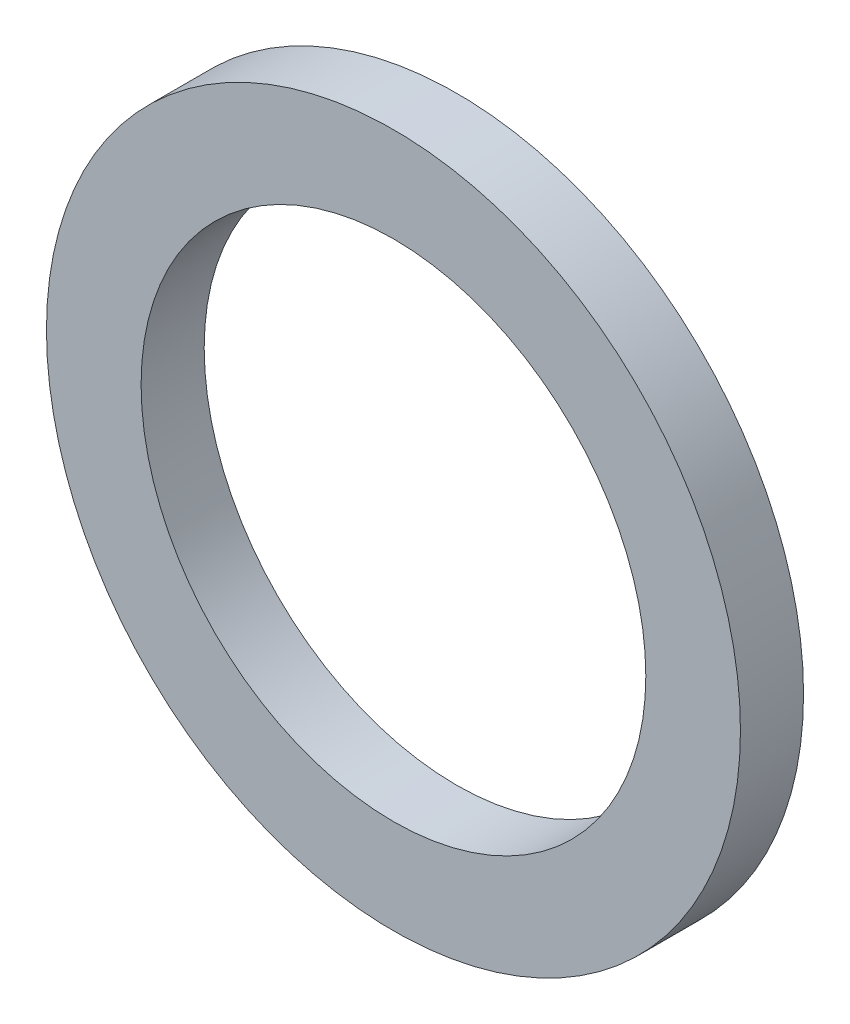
from build123d import *

# Parameters (mm, degrees)
SKETCH1_R      = 27.5
SKETCH1_R_2    = 20
EXTRUDE1_DEPTH = 5


with BuildPart() as part:
    # Sketch1 → Extrude1 (new body)
    with BuildSketch(Plane.XY):
        with Locations(Location((0, 0, 0), (0, 0, 180))):
            Circle(SKETCH1_R)
        with Locations(Location((0, 0, 0), (0, 0, 180))):
            Circle(SKETCH1_R_2, mode=Mode.SUBTRACT)
    extrude(amount=EXTRUDE1_DEPTH)


solid = part.part
